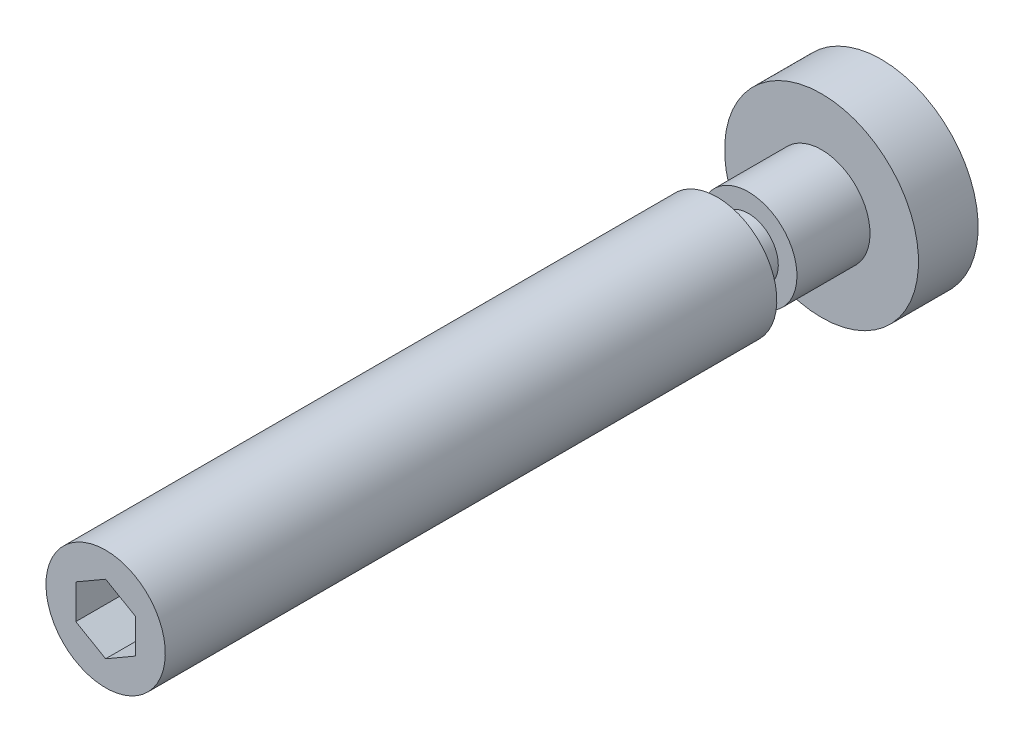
ISO-10303-21;
HEADER;
FILE_DESCRIPTION(('STEP AP214'),'2;1');
FILE_NAME('part.step','',(''),(''),'','','');
FILE_SCHEMA(('AUTOMOTIVE_DESIGN { 1 0 10303 214 1 1 1 1 }'));
ENDSEC;
DATA;
#1=APPLICATION_CONTEXT('core data for automotive mechanical design processes');
#2=APPLICATION_PROTOCOL_DEFINITION('international standard','automotive_design',2000,#1);
#3=PRODUCT_CONTEXT('',#1,'mechanical');
#4=PRODUCT('Part','Part','',(#3));
#5=PRODUCT_RELATED_PRODUCT_CATEGORY('part','',(#4));
#6=PRODUCT_DEFINITION_FORMATION('','',#4);
#7=PRODUCT_DEFINITION_CONTEXT('part definition',#1,'design');
#8=PRODUCT_DEFINITION('design','',#6,#7);
#9=PRODUCT_DEFINITION_SHAPE('','',#8);
#10=(LENGTH_UNIT() NAMED_UNIT(*) SI_UNIT(.MILLI.,.METRE.));
#11=(NAMED_UNIT(*) PLANE_ANGLE_UNIT() SI_UNIT($,.RADIAN.));
#12=(NAMED_UNIT(*) SI_UNIT($,.STERADIAN.) SOLID_ANGLE_UNIT());
#13=UNCERTAINTY_MEASURE_WITH_UNIT(LENGTH_MEASURE(1.E-05),#10,'distance_accuracy_value','');
#14=(GEOMETRIC_REPRESENTATION_CONTEXT(3) GLOBAL_UNCERTAINTY_ASSIGNED_CONTEXT((#13)) GLOBAL_UNIT_ASSIGNED_CONTEXT((#10,
#11,#12)) REPRESENTATION_CONTEXT('',''));
#15=CARTESIAN_POINT('',(0.,0.,0.));
#16=DIRECTION('',(0.,0.,1.));
#17=DIRECTION('',(1.,0.,0.));
#18=AXIS2_PLACEMENT_3D('',#15,#16,#17);
#19=CARTESIAN_POINT('',(0.,0.,0.));
#20=DIRECTION('',(0.,0.,1.));
#21=DIRECTION('',(0.,1.,0.));
#22=AXIS2_PLACEMENT_3D('',#19,#20,#21);
#23=PLANE('',#22);
#24=CARTESIAN_POINT('',(0.,0.,0.));
#25=DIRECTION('',(0.,0.,1.));
#26=DIRECTION('',(0.,1.,0.));
#27=AXIS2_PLACEMENT_3D('',#24,#25,#26);
#28=CIRCLE('',#27,6.5);
#29=CARTESIAN_POINT('',(0.,6.5,0.));
#30=VERTEX_POINT('',#29);
#31=EDGE_CURVE('E17',#30,#30,#28,.T.);
#32=ORIENTED_EDGE('',*,*,#31,.F.);
#33=EDGE_LOOP('',(#32));
#34=FACE_BOUND('',#33,.T.);
#35=ADVANCED_FACE('F14',(#34),#23,.F.);
#36=CARTESIAN_POINT('',(0.,0.,40.));
#37=DIRECTION('',(0.,0.,1.));
#38=DIRECTION('',(0.,1.,0.));
#39=AXIS2_PLACEMENT_3D('',#36,#37,#38);
#40=CYLINDRICAL_SURFACE('',#39,6.5);
#41=CARTESIAN_POINT('',(0.,0.,4.));
#42=DIRECTION('',(0.,0.,1.));
#43=DIRECTION('',(0.,1.,0.));
#44=AXIS2_PLACEMENT_3D('',#41,#42,#43);
#45=CIRCLE('',#44,6.5);
#46=CARTESIAN_POINT('',(0.,6.5,4.));
#47=VERTEX_POINT('',#46);
#48=EDGE_CURVE('E133',#47,#47,#45,.T.);
#49=ORIENTED_EDGE('',*,*,#48,.F.);
#50=EDGE_LOOP('',(#49));
#51=FACE_BOUND('',#50,.T.);
#52=ORIENTED_EDGE('',*,*,#31,.T.);
#53=EDGE_LOOP('',(#52));
#54=FACE_BOUND('',#53,.T.);
#55=ADVANCED_FACE('F140',(#51,#54),#40,.T.);
#56=CARTESIAN_POINT('',(0.,-6.5,4.));
#57=DIRECTION('',(0.,0.,-1.));
#58=DIRECTION('',(0.,-1.,0.));
#59=AXIS2_PLACEMENT_3D('',#56,#57,#58);
#60=PLANE('',#59);
#61=CARTESIAN_POINT('',(0.,0.,4.));
#62=DIRECTION('',(0.,0.,1.));
#63=DIRECTION('',(0.,1.,0.));
#64=AXIS2_PLACEMENT_3D('',#61,#62,#63);
#65=CIRCLE('',#64,3.25);
#66=CARTESIAN_POINT('',(0.,3.25,4.));
#67=VERTEX_POINT('',#66);
#68=EDGE_CURVE('E131',#67,#67,#65,.T.);
#69=ORIENTED_EDGE('',*,*,#68,.F.);
#70=EDGE_LOOP('',(#69));
#71=FACE_BOUND('',#70,.T.);
#72=ORIENTED_EDGE('',*,*,#48,.T.);
#73=EDGE_LOOP('',(#72));
#74=FACE_BOUND('',#73,.T.);
#75=ADVANCED_FACE('F148',(#71,#74),#60,.F.);
#76=CARTESIAN_POINT('',(0.,0.,40.));
#77=DIRECTION('',(0.,0.,1.));
#78=DIRECTION('',(0.,1.,0.));
#79=AXIS2_PLACEMENT_3D('',#76,#77,#78);
#80=CYLINDRICAL_SURFACE('',#79,3.25);
#81=CARTESIAN_POINT('',(0.,0.,8.9));
#82=DIRECTION('',(0.,0.,1.));
#83=DIRECTION('',(0.,1.,0.));
#84=AXIS2_PLACEMENT_3D('',#81,#82,#83);
#85=CIRCLE('',#84,3.25);
#86=CARTESIAN_POINT('',(0.,3.25,8.9));
#87=VERTEX_POINT('',#86);
#88=EDGE_CURVE('E128',#87,#87,#85,.T.);
#89=ORIENTED_EDGE('',*,*,#88,.F.);
#90=EDGE_LOOP('',(#89));
#91=FACE_BOUND('',#90,.T.);
#92=ORIENTED_EDGE('',*,*,#68,.T.);
#93=EDGE_LOOP('',(#92));
#94=FACE_BOUND('',#93,.T.);
#95=ADVANCED_FACE('F162',(#91,#94),#80,.T.);
#96=CARTESIAN_POINT('',(0.,-3.25,8.9));
#97=DIRECTION('',(0.,0.,-1.));
#98=DIRECTION('',(0.,-1.,0.));
#99=AXIS2_PLACEMENT_3D('',#96,#97,#98);
#100=PLANE('',#99);
#101=CARTESIAN_POINT('',(0.,0.,8.9));
#102=DIRECTION('',(0.,0.,1.));
#103=DIRECTION('',(0.,1.,0.));
#104=AXIS2_PLACEMENT_3D('',#101,#102,#103);
#105=CIRCLE('',#104,2.);
#106=CARTESIAN_POINT('',(0.,2.,8.9));
#107=VERTEX_POINT('',#106);
#108=EDGE_CURVE('E124',#107,#107,#105,.T.);
#109=ORIENTED_EDGE('',*,*,#108,.F.);
#110=EDGE_LOOP('',(#109));
#111=FACE_BOUND('',#110,.T.);
#112=ORIENTED_EDGE('',*,*,#88,.T.);
#113=EDGE_LOOP('',(#112));
#114=FACE_BOUND('',#113,.T.);
#115=ADVANCED_FACE('F156',(#111,#114),#100,.F.);
#116=CARTESIAN_POINT('',(0.,0.,40.));
#117=DIRECTION('',(0.,0.,1.));
#118=DIRECTION('',(0.,1.,0.));
#119=AXIS2_PLACEMENT_3D('',#116,#117,#118);
#120=CYLINDRICAL_SURFACE('',#119,2.);
#121=CARTESIAN_POINT('',(0.,0.,11.));
#122=DIRECTION('',(0.,0.,1.));
#123=DIRECTION('',(0.,1.,0.));
#124=AXIS2_PLACEMENT_3D('',#121,#122,#123);
#125=CIRCLE('',#124,2.);
#126=CARTESIAN_POINT('',(0.,2.,11.));
#127=VERTEX_POINT('',#126);
#128=EDGE_CURVE('E9',#127,#127,#125,.T.);
#129=ORIENTED_EDGE('',*,*,#128,.F.);
#130=EDGE_LOOP('',(#129));
#131=FACE_BOUND('',#130,.T.);
#132=ORIENTED_EDGE('',*,*,#108,.T.);
#133=EDGE_LOOP('',(#132));
#134=FACE_BOUND('',#133,.T.);
#135=ADVANCED_FACE('F152',(#131,#134),#120,.T.);
#136=CARTESIAN_POINT('',(0.,0.,11.));
#137=DIRECTION('',(0.,0.,1.));
#138=DIRECTION('',(1.,0.,0.));
#139=AXIS2_PLACEMENT_3D('',#136,#137,#138);
#140=CYLINDRICAL_SURFACE('',#139,4.);
#141=CARTESIAN_POINT('',(0.,0.,11.));
#142=DIRECTION('',(0.,0.,-1.));
#143=DIRECTION('',(-1.,0.,0.));
#144=AXIS2_PLACEMENT_3D('',#141,#142,#143);
#145=CIRCLE('',#144,4.);
#146=CARTESIAN_POINT('',(-4.,0.,11.));
#147=VERTEX_POINT('',#146);
#148=EDGE_CURVE('E108',#147,#147,#145,.T.);
#149=ORIENTED_EDGE('',*,*,#148,.F.);
#150=EDGE_LOOP('',(#149));
#151=FACE_BOUND('',#150,.T.);
#152=CARTESIAN_POINT('',(0.,0.,52.));
#153=DIRECTION('',(0.,0.,1.));
#154=DIRECTION('',(0.,1.,0.));
#155=AXIS2_PLACEMENT_3D('',#152,#153,#154);
#156=CIRCLE('',#155,4.);
#157=CARTESIAN_POINT('',(0.,4.,52.));
#158=VERTEX_POINT('',#157);
#159=EDGE_CURVE('E293',#158,#158,#156,.T.);
#160=ORIENTED_EDGE('',*,*,#159,.F.);
#161=EDGE_LOOP('',(#160));
#162=FACE_BOUND('',#161,.T.);
#163=ADVANCED_FACE('F143',(#151,#162),#140,.T.);
#164=CARTESIAN_POINT('',(0.,0.,11.));
#165=DIRECTION('',(0.,0.,-1.));
#166=DIRECTION('',(-1.,0.,0.));
#167=AXIS2_PLACEMENT_3D('',#164,#165,#166);
#168=PLANE('',#167);
#169=ORIENTED_EDGE('',*,*,#128,.T.);
#170=EDGE_LOOP('',(#169));
#171=FACE_BOUND('',#170,.T.);
#172=ORIENTED_EDGE('',*,*,#148,.T.);
#173=EDGE_LOOP('',(#172));
#174=FACE_BOUND('',#173,.T.);
#175=ADVANCED_FACE('F151',(#171,#174),#168,.T.);
#176=CARTESIAN_POINT('',(0.,2.30940107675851,47.));
#177=DIRECTION('',(0.,0.,1.));
#178=DIRECTION('',(1.,0.,0.));
#179=AXIS2_PLACEMENT_3D('',#176,#177,#178);
#180=PLANE('',#179);
#181=DIRECTION('',(-0.866025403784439,0.5,0.));
#182=VECTOR('',#181,1.);
#183=CARTESIAN_POINT('',(2.,1.15470053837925,47.));
#184=LINE('',#183,#182);
#185=CARTESIAN_POINT('',(2.,1.15470053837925,47.));
#186=VERTEX_POINT('',#185);
#187=CARTESIAN_POINT('',(0.,2.30940107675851,47.));
#188=VERTEX_POINT('',#187);
#189=EDGE_CURVE('E99',#186,#188,#184,.T.);
#190=ORIENTED_EDGE('',*,*,#189,.T.);
#191=DIRECTION('',(-0.866025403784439,-0.5,0.));
#192=VECTOR('',#191,1.);
#193=CARTESIAN_POINT('',(0.,2.30940107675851,47.));
#194=LINE('',#193,#192);
#195=CARTESIAN_POINT('',(-2.,1.15470053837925,47.));
#196=VERTEX_POINT('',#195);
#197=EDGE_CURVE('E118',#188,#196,#194,.T.);
#198=ORIENTED_EDGE('',*,*,#197,.T.);
#199=DIRECTION('',(0.,-1.,0.));
#200=VECTOR('',#199,1.);
#201=CARTESIAN_POINT('',(-2.,1.15470053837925,47.));
#202=LINE('',#201,#200);
#203=CARTESIAN_POINT('',(-2.,-1.15470053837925,47.));
#204=VERTEX_POINT('',#203);
#205=EDGE_CURVE('E115',#196,#204,#202,.T.);
#206=ORIENTED_EDGE('',*,*,#205,.T.);
#207=DIRECTION('',(0.866025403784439,-0.5,0.));
#208=VECTOR('',#207,1.);
#209=CARTESIAN_POINT('',(-2.,-1.15470053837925,47.));
#210=LINE('',#209,#208);
#211=CARTESIAN_POINT('',(0.,-2.30940107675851,47.));
#212=VERTEX_POINT('',#211);
#213=EDGE_CURVE('E113',#204,#212,#210,.T.);
#214=ORIENTED_EDGE('',*,*,#213,.T.);
#215=DIRECTION('',(0.866025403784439,0.5,0.));
#216=VECTOR('',#215,1.);
#217=CARTESIAN_POINT('',(0.,-2.30940107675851,47.));
#218=LINE('',#217,#216);
#219=CARTESIAN_POINT('',(2.,-1.15470053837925,47.));
#220=VERTEX_POINT('',#219);
#221=EDGE_CURVE('E79',#212,#220,#218,.T.);
#222=ORIENTED_EDGE('',*,*,#221,.T.);
#223=DIRECTION('',(0.,1.,0.));
#224=VECTOR('',#223,1.);
#225=CARTESIAN_POINT('',(2.,-1.15470053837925,47.));
#226=LINE('',#225,#224);
#227=EDGE_CURVE('E109',#220,#186,#226,.T.);
#228=ORIENTED_EDGE('',*,*,#227,.T.);
#229=EDGE_LOOP('',(#190,#198,#206,#214,#222,#228));
#230=FACE_BOUND('',#229,.T.);
#231=ADVANCED_FACE('F216',(#230),#180,.T.);
#232=CARTESIAN_POINT('',(-2.,1.15470053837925,47.));
#233=DIRECTION('',(-1.,0.,0.));
#234=DIRECTION('',(0.,-1.,0.));
#235=AXIS2_PLACEMENT_3D('',#232,#233,#234);
#236=PLANE('',#235);
#237=DIRECTION('',(0.,-1.,0.));
#238=VECTOR('',#237,1.);
#239=CARTESIAN_POINT('',(-2.,1.15470053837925,52.));
#240=LINE('',#239,#238);
#241=CARTESIAN_POINT('',(-2.,1.15470053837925,52.));
#242=VERTEX_POINT('',#241);
#243=CARTESIAN_POINT('',(-2.,-1.15470053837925,52.));
#244=VERTEX_POINT('',#243);
#245=EDGE_CURVE('E91',#242,#244,#240,.T.);
#246=ORIENTED_EDGE('',*,*,#245,.T.);
#247=DIRECTION('',(0.,0.,1.));
#248=VECTOR('',#247,1.);
#249=CARTESIAN_POINT('',(-2.,-1.15470053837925,47.));
#250=LINE('',#249,#248);
#251=EDGE_CURVE('E83',#204,#244,#250,.T.);
#252=ORIENTED_EDGE('',*,*,#251,.F.);
#253=ORIENTED_EDGE('',*,*,#205,.F.);
#254=DIRECTION('',(0.,0.,1.));
#255=VECTOR('',#254,1.);
#256=CARTESIAN_POINT('',(-2.,1.15470053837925,47.));
#257=LINE('',#256,#255);
#258=EDGE_CURVE('E31',#196,#242,#257,.T.);
#259=ORIENTED_EDGE('',*,*,#258,.T.);
#260=EDGE_LOOP('',(#246,#252,#253,#259));
#261=FACE_BOUND('',#260,.T.);
#262=ADVANCED_FACE('F226',(#261),#236,.F.);
#263=CARTESIAN_POINT('',(-2.,-1.15470053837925,47.));
#264=DIRECTION('',(-0.5,-0.866025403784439,0.));
#265=DIRECTION('',(0.866025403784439,-0.5,0.));
#266=AXIS2_PLACEMENT_3D('',#263,#264,#265);
#267=PLANE('',#266);
#268=DIRECTION('',(0.866025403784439,-0.5,0.));
#269=VECTOR('',#268,1.);
#270=CARTESIAN_POINT('',(-2.,-1.15470053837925,52.));
#271=LINE('',#270,#269);
#272=CARTESIAN_POINT('',(0.,-2.30940107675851,52.));
#273=VERTEX_POINT('',#272);
#274=EDGE_CURVE('E87',#244,#273,#271,.T.);
#275=ORIENTED_EDGE('',*,*,#274,.T.);
#276=DIRECTION('',(0.,0.,1.));
#277=VECTOR('',#276,1.);
#278=CARTESIAN_POINT('',(0.,-2.30940107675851,47.));
#279=LINE('',#278,#277);
#280=EDGE_CURVE('E72',#212,#273,#279,.T.);
#281=ORIENTED_EDGE('',*,*,#280,.F.);
#282=ORIENTED_EDGE('',*,*,#213,.F.);
#283=ORIENTED_EDGE('',*,*,#251,.T.);
#284=EDGE_LOOP('',(#275,#281,#282,#283));
#285=FACE_BOUND('',#284,.T.);
#286=ADVANCED_FACE('F88',(#285),#267,.F.);
#287=CARTESIAN_POINT('',(0.,-2.30940107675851,47.));
#288=DIRECTION('',(0.5,-0.866025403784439,0.));
#289=DIRECTION('',(0.866025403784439,0.5,0.));
#290=AXIS2_PLACEMENT_3D('',#287,#288,#289);
#291=PLANE('',#290);
#292=DIRECTION('',(0.866025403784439,0.5,0.));
#293=VECTOR('',#292,1.);
#294=CARTESIAN_POINT('',(0.,-2.30940107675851,52.));
#295=LINE('',#294,#293);
#296=CARTESIAN_POINT('',(2.,-1.15470053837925,52.));
#297=VERTEX_POINT('',#296);
#298=EDGE_CURVE('E76',#273,#297,#295,.T.);
#299=ORIENTED_EDGE('',*,*,#298,.T.);
#300=DIRECTION('',(0.,0.,1.));
#301=VECTOR('',#300,1.);
#302=CARTESIAN_POINT('',(2.,-1.15470053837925,47.));
#303=LINE('',#302,#301);
#304=EDGE_CURVE('E84',#220,#297,#303,.T.);
#305=ORIENTED_EDGE('',*,*,#304,.F.);
#306=ORIENTED_EDGE('',*,*,#221,.F.);
#307=ORIENTED_EDGE('',*,*,#280,.T.);
#308=EDGE_LOOP('',(#299,#305,#306,#307));
#309=FACE_BOUND('',#308,.T.);
#310=ADVANCED_FACE('F74',(#309),#291,.F.);
#311=CARTESIAN_POINT('',(2.,-1.15470053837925,47.));
#312=DIRECTION('',(1.,0.,0.));
#313=DIRECTION('',(0.,0.,-1.));
#314=AXIS2_PLACEMENT_3D('',#311,#312,#313);
#315=PLANE('',#314);
#316=DIRECTION('',(0.,1.,0.));
#317=VECTOR('',#316,1.);
#318=CARTESIAN_POINT('',(2.,-1.15470053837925,52.));
#319=LINE('',#318,#317);
#320=CARTESIAN_POINT('',(2.,1.15470053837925,52.));
#321=VERTEX_POINT('',#320);
#322=EDGE_CURVE('E97',#297,#321,#319,.T.);
#323=ORIENTED_EDGE('',*,*,#322,.T.);
#324=DIRECTION('',(0.,0.,1.));
#325=VECTOR('',#324,1.);
#326=CARTESIAN_POINT('',(2.,1.15470053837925,47.));
#327=LINE('',#326,#325);
#328=EDGE_CURVE('E63',#186,#321,#327,.T.);
#329=ORIENTED_EDGE('',*,*,#328,.F.);
#330=ORIENTED_EDGE('',*,*,#227,.F.);
#331=ORIENTED_EDGE('',*,*,#304,.T.);
#332=EDGE_LOOP('',(#323,#329,#330,#331));
#333=FACE_BOUND('',#332,.T.);
#334=ADVANCED_FACE('F252',(#333),#315,.F.);
#335=CARTESIAN_POINT('',(2.,1.15470053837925,47.));
#336=DIRECTION('',(0.5,0.866025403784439,0.));
#337=DIRECTION('',(-0.866025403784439,0.5,0.));
#338=AXIS2_PLACEMENT_3D('',#335,#336,#337);
#339=PLANE('',#338);
#340=DIRECTION('',(-0.866025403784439,0.5,0.));
#341=VECTOR('',#340,1.);
#342=CARTESIAN_POINT('',(2.,1.15470053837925,52.));
#343=LINE('',#342,#341);
#344=CARTESIAN_POINT('',(0.,2.30940107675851,52.));
#345=VERTEX_POINT('',#344);
#346=EDGE_CURVE('E106',#321,#345,#343,.T.);
#347=ORIENTED_EDGE('',*,*,#346,.T.);
#348=DIRECTION('',(0.,0.,1.));
#349=VECTOR('',#348,1.);
#350=CARTESIAN_POINT('',(0.,2.30940107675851,47.));
#351=LINE('',#350,#349);
#352=EDGE_CURVE('E59',#188,#345,#351,.T.);
#353=ORIENTED_EDGE('',*,*,#352,.F.);
#354=ORIENTED_EDGE('',*,*,#189,.F.);
#355=ORIENTED_EDGE('',*,*,#328,.T.);
#356=EDGE_LOOP('',(#347,#353,#354,#355));
#357=FACE_BOUND('',#356,.T.);
#358=ADVANCED_FACE('F261',(#357),#339,.F.);
#359=CARTESIAN_POINT('',(0.,2.30940107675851,47.));
#360=DIRECTION('',(-0.5,0.866025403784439,0.));
#361=DIRECTION('',(-0.866025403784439,-0.5,0.));
#362=AXIS2_PLACEMENT_3D('',#359,#360,#361);
#363=PLANE('',#362);
#364=DIRECTION('',(-0.866025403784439,-0.5,0.));
#365=VECTOR('',#364,1.);
#366=CARTESIAN_POINT('',(0.,2.30940107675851,52.));
#367=LINE('',#366,#365);
#368=EDGE_CURVE('E104',#345,#242,#367,.T.);
#369=ORIENTED_EDGE('',*,*,#368,.T.);
#370=ORIENTED_EDGE('',*,*,#258,.F.);
#371=ORIENTED_EDGE('',*,*,#197,.F.);
#372=ORIENTED_EDGE('',*,*,#352,.T.);
#373=EDGE_LOOP('',(#369,#370,#371,#372));
#374=FACE_BOUND('',#373,.T.);
#375=ADVANCED_FACE('F271',(#374),#363,.F.);
#376=CARTESIAN_POINT('',(0.,-4.,52.));
#377=DIRECTION('',(0.,0.,-1.));
#378=DIRECTION('',(0.,-1.,0.));
#379=AXIS2_PLACEMENT_3D('',#376,#377,#378);
#380=PLANE('',#379);
#381=ORIENTED_EDGE('',*,*,#368,.F.);
#382=ORIENTED_EDGE('',*,*,#346,.F.);
#383=ORIENTED_EDGE('',*,*,#322,.F.);
#384=ORIENTED_EDGE('',*,*,#298,.F.);
#385=ORIENTED_EDGE('',*,*,#274,.F.);
#386=ORIENTED_EDGE('',*,*,#245,.F.);
#387=EDGE_LOOP('',(#381,#382,#383,#384,#385,#386));
#388=FACE_BOUND('',#387,.T.);
#389=ORIENTED_EDGE('',*,*,#159,.T.);
#390=EDGE_LOOP('',(#389));
#391=FACE_BOUND('',#390,.T.);
#392=ADVANCED_FACE('F94',(#388,#391),#380,.F.);
#393=CLOSED_SHELL('',(#35,#55,#75,#95,#115,#135,#163,#175,#231,#262,#286,#310,#334,#358,#375,#392));
#394=MANIFOLD_SOLID_BREP('B1',#393);
#395=ADVANCED_BREP_SHAPE_REPRESENTATION('',(#18,#394),#14);
#396=SHAPE_DEFINITION_REPRESENTATION(#9,#395);
ENDSEC;
END-ISO-10303-21;
